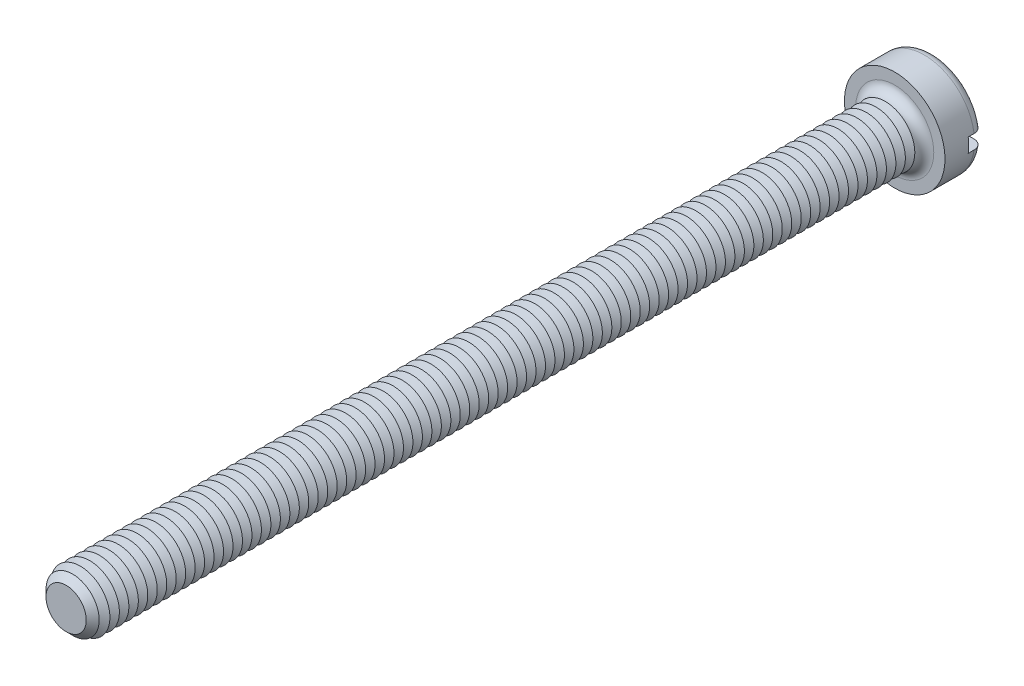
from build123d import *

# Parameters (mm, degrees)
SKETCH3_R           = 4.25
BOSS_EXTRUDE2_DEPTH = 3.3
SKETCH4_R           = 2.5
BOSS_EXTRUDE3_DEPTH = 70
FILLET1_R           = 0.8
CHAMFER1_SIZE       = 0.8
LPATTERN1_COUNT     = 86
LPATTERN1_PITCH     = 0.8
SKETCH8_W           = 8.5
SKETCH8_H           = 1.2
CUT_EXTRUDE1_DEPTH  = 1.3


with BuildPart() as part:
    # Sketch3 → Boss-Extrude2 (new body)
    with BuildSketch(Plane.XY):
        Circle(SKETCH3_R)
    extrude(amount=-BOSS_EXTRUDE2_DEPTH)

    # Sketch4 → Boss-Extrude3 (add)
    with BuildSketch(Plane.XY):
        Circle(SKETCH4_R)
    extrude(amount=BOSS_EXTRUDE3_DEPTH)

    # Fillet1
    fillet1_edges = [part.edges().sort_by_distance(p)[0] for p in [
        (-4.25, 0, -3.3),
        (-2.5, 0, 0),
    ]]
    fillet(fillet1_edges, radius=FILLET1_R)

    # Chamfer1
    chamfer1_edges = [part.edges().sort_by_distance(p)[0] for p in [
        (-2.5, 0, 70),
    ]]
    chamfer(chamfer1_edges, length=CHAMFER1_SIZE)

    # Sketch6 → Cut-Revolve1 (revolve, cut)
    with BuildSketch(Plane(origin=(0, 0, 0), x_dir=(0, 0, -1), z_dir=(1, 0, 0)), mode=Mode.PRIVATE) as cut_revolve1_sk:
        Polygon((-0.8, 2.5), (-1.2, 1.807179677), (-1.6, 2.5), align=None)
    cut_revolve1 = revolve(cut_revolve1_sk.sketch.rotate(Axis((0, 0, -1.694361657), (0, 0, 1)), 90), axis=Axis((0, 0, -1.694361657), (0, 0, 1)), mode=Mode.SUBTRACT)

    # LPattern1: Cut-Revolve1 ×86
    with Locations(*[(0, 0, i * LPATTERN1_PITCH) for i in range(1, LPATTERN1_COUNT)]):
        add(cut_revolve1, mode=Mode.SUBTRACT)

    # Sketch8 → Cut-Extrude1 (cut)
    with BuildSketch(Plane(origin=(0, 0, -3.3), x_dir=(-1, 0, 0), z_dir=(0, 0, -1))):
        Rectangle(SKETCH8_W, SKETCH8_H)
    extrude(amount=-CUT_EXTRUDE1_DEPTH, mode=Mode.SUBTRACT)


solid = part.part
